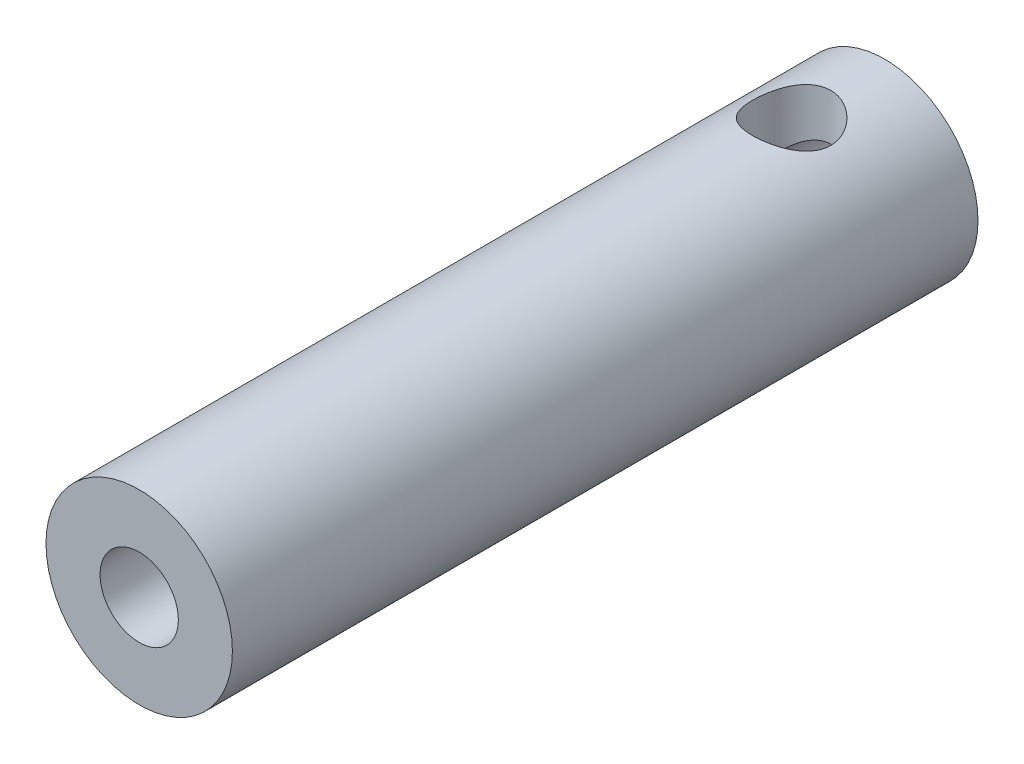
ISO-10303-21;
HEADER;
FILE_DESCRIPTION(('STEP AP214'),'2;1');
FILE_NAME('part.step','',(''),(''),'','','');
FILE_SCHEMA(('AUTOMOTIVE_DESIGN { 1 0 10303 214 1 1 1 1 }'));
ENDSEC;
DATA;
#1=APPLICATION_CONTEXT('core data for automotive mechanical design processes');
#2=APPLICATION_PROTOCOL_DEFINITION('international standard','automotive_design',2000,#1);
#3=PRODUCT_CONTEXT('',#1,'mechanical');
#4=PRODUCT('Part','Part','',(#3));
#5=PRODUCT_RELATED_PRODUCT_CATEGORY('part','',(#4));
#6=PRODUCT_DEFINITION_FORMATION('','',#4);
#7=PRODUCT_DEFINITION_CONTEXT('part definition',#1,'design');
#8=PRODUCT_DEFINITION('design','',#6,#7);
#9=PRODUCT_DEFINITION_SHAPE('','',#8);
#10=(LENGTH_UNIT() NAMED_UNIT(*) SI_UNIT(.MILLI.,.METRE.));
#11=(NAMED_UNIT(*) PLANE_ANGLE_UNIT() SI_UNIT($,.RADIAN.));
#12=(NAMED_UNIT(*) SI_UNIT($,.STERADIAN.) SOLID_ANGLE_UNIT());
#13=UNCERTAINTY_MEASURE_WITH_UNIT(LENGTH_MEASURE(1.E-05),#10,'distance_accuracy_value','');
#14=(GEOMETRIC_REPRESENTATION_CONTEXT(3) GLOBAL_UNCERTAINTY_ASSIGNED_CONTEXT((#13)) GLOBAL_UNIT_ASSIGNED_CONTEXT((#10,
#11,#12)) REPRESENTATION_CONTEXT('',''));
#15=CARTESIAN_POINT('',(0.,0.,0.));
#16=DIRECTION('',(0.,0.,1.));
#17=DIRECTION('',(1.,0.,0.));
#18=AXIS2_PLACEMENT_3D('',#15,#16,#17);
#19=CARTESIAN_POINT('',(0.,0.,40.));
#20=DIRECTION('',(0.,0.,-1.));
#21=DIRECTION('',(-1.,0.,0.));
#22=AXIS2_PLACEMENT_3D('',#19,#20,#21);
#23=CYLINDRICAL_SURFACE('',#22,5.);
#24=CARTESIAN_POINT('',(0.,5.,7.09999999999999));
#25=CARTESIAN_POINT('',(-0.112421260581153,4.99999333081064,7.0999912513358));
#26=CARTESIAN_POINT('',(-0.225000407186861,4.99616592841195,7.0909214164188));
#27=CARTESIAN_POINT('',(-0.446972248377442,4.98123118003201,7.05497450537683));
#28=CARTESIAN_POINT('',(-0.556355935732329,4.97010500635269,7.02805137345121));
#29=CARTESIAN_POINT('',(-0.768350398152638,4.94176430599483,6.95756693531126));
#30=CARTESIAN_POINT('',(-0.870982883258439,4.92457055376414,6.91406236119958));
#31=CARTESIAN_POINT('',(-1.06739278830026,4.8857658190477,6.81188714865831));
#32=CARTESIAN_POINT('',(-1.16117280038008,4.8641561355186,6.75322096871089));
#33=CARTESIAN_POINT('',(-1.34213382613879,4.81744880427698,6.61923837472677));
#34=CARTESIAN_POINT('',(-1.42880573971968,4.79223574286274,6.54327496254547));
#35=CARTESIAN_POINT('',(-1.58861874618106,4.74165902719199,6.37822285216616));
#36=CARTESIAN_POINT('',(-1.66175260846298,4.71629529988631,6.28912718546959));
#37=CARTESIAN_POINT('',(-1.79604183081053,4.66686358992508,6.09492195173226));
#38=CARTESIAN_POINT('',(-1.8564119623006,4.64292449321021,5.98923315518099));
#39=CARTESIAN_POINT('',(-1.9582903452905,4.60088674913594,5.76805063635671));
#40=CARTESIAN_POINT('',(-1.99980846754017,4.58278504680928,5.65256208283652));
#41=CARTESIAN_POINT('',(-2.06069339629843,4.55572282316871,5.42091862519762));
#42=CARTESIAN_POINT('',(-2.08104088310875,4.54635990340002,5.30507032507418));
#43=CARTESIAN_POINT('',(-2.1020655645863,4.53668036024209,5.07125462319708));
#44=CARTESIAN_POINT('',(-2.10275385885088,4.53635863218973,4.95328845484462));
#45=CARTESIAN_POINT('',(-2.08517838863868,4.54445782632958,4.72842726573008));
#46=CARTESIAN_POINT('',(-2.0683911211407,4.55219766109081,4.62138734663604));
#47=CARTESIAN_POINT('',(-2.01882069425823,4.57439532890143,4.41181403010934));
#48=CARTESIAN_POINT('',(-1.98603441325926,4.58885447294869,4.30928151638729));
#49=CARTESIAN_POINT('',(-1.9047552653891,4.62318960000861,4.10902281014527));
#50=CARTESIAN_POINT('',(-1.8559407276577,4.64317507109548,4.01144679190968));
#51=CARTESIAN_POINT('',(-1.74421855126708,4.6862864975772,3.82548751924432));
#52=CARTESIAN_POINT('',(-1.68130530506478,4.70941370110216,3.73710794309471));
#53=CARTESIAN_POINT('',(-1.53682141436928,4.75862189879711,3.56405042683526));
#54=CARTESIAN_POINT('',(-1.4541115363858,4.78478586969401,3.48034449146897));
#55=CARTESIAN_POINT('',(-1.27557303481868,4.83544396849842,3.32766206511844));
#56=CARTESIAN_POINT('',(-1.17974124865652,4.85993769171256,3.25868913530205));
#57=CARTESIAN_POINT('',(-0.974684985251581,4.90522758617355,3.13597384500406));
#58=CARTESIAN_POINT('',(-0.865196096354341,4.92592190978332,3.08263293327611));
#59=CARTESIAN_POINT('',(-0.637707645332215,4.96049707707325,2.99546952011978));
#60=CARTESIAN_POINT('',(-0.519712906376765,4.97438174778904,2.96163605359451));
#61=CARTESIAN_POINT('',(-0.286679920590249,4.99305470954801,2.9164964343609));
#62=CARTESIAN_POINT('',(-0.171936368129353,4.9983686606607,2.90388621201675));
#63=CARTESIAN_POINT('',(0.0581412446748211,5.00098385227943,2.89765565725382));
#64=CARTESIAN_POINT('',(0.173475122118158,4.99828744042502,2.90402976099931));
#65=CARTESIAN_POINT('',(0.395312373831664,4.98552504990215,2.93465874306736));
#66=CARTESIAN_POINT('',(0.501967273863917,4.9758388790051,2.95799252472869));
#67=CARTESIAN_POINT('',(0.709728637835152,4.95047932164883,3.02059068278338));
#68=CARTESIAN_POINT('',(0.810834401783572,4.93480518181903,3.05985706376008));
#69=CARTESIAN_POINT('',(1.00818189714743,4.8983626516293,3.15448695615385));
#70=CARTESIAN_POINT('',(1.10417428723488,4.87745088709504,3.21031345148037));
#71=CARTESIAN_POINT('',(1.2857730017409,4.83275775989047,3.33597087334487));
#72=CARTESIAN_POINT('',(1.37137493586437,4.80897519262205,3.40580768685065));
#73=CARTESIAN_POINT('',(1.53629380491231,4.75896603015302,3.56342906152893));
#74=CARTESIAN_POINT('',(1.61470399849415,4.73268731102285,3.65214822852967));
#75=CARTESIAN_POINT('',(1.75578239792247,4.68218504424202,3.84189457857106));
#76=CARTESIAN_POINT('',(1.81844681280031,4.65796199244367,3.94292471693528));
#77=CARTESIAN_POINT('',(1.92699302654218,4.61412955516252,4.15663233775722));
#78=CARTESIAN_POINT('',(1.97260446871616,4.59459611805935,4.26946387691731));
#79=CARTESIAN_POINT('',(2.04378702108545,4.56338397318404,4.50228555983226));
#80=CARTESIAN_POINT('',(2.06937501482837,4.55169864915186,4.62226958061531));
#81=CARTESIAN_POINT('',(2.09809375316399,4.53852721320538,4.85591227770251));
#82=CARTESIAN_POINT('',(2.10281966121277,4.53631703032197,4.96933490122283));
#83=CARTESIAN_POINT('',(2.09395263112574,4.54041709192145,5.19529294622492));
#84=CARTESIAN_POINT('',(2.08036261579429,4.54672597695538,5.30782850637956));
#85=CARTESIAN_POINT('',(2.03659654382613,4.56648699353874,5.52324018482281));
#86=CARTESIAN_POINT('',(2.00724892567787,4.57958128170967,5.626320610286));
#87=CARTESIAN_POINT('',(1.93361811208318,4.61115138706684,5.82611424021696));
#88=CARTESIAN_POINT('',(1.8893307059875,4.62962872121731,5.92282564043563));
#89=CARTESIAN_POINT('',(1.78398506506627,4.67127236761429,6.11354185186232));
#90=CARTESIAN_POINT('',(1.72207244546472,4.69465512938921,6.2070265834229));
#91=CARTESIAN_POINT('',(1.58442236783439,4.74288120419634,6.38277882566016));
#92=CARTESIAN_POINT('',(1.50867999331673,4.76772503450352,6.46504232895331));
#93=CARTESIAN_POINT('',(1.33881414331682,4.81829681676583,6.62232622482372));
#94=CARTESIAN_POINT('',(1.24374163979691,4.84395273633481,6.69635035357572));
#95=CARTESIAN_POINT('',(1.04160910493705,4.89140406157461,6.82745043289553));
#96=CARTESIAN_POINT('',(0.934543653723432,4.91319771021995,6.88451867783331));
#97=CARTESIAN_POINT('',(0.712909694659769,4.9501639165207,6.97888688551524));
#98=CARTESIAN_POINT('',(0.598488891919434,4.96543696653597,7.01648893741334));
#99=CARTESIAN_POINT('',(0.423046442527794,4.98242021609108,7.0578272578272));
#100=CARTESIAN_POINT('',(0.363983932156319,4.98709206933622,7.06909260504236));
#101=CARTESIAN_POINT('',(0.24499384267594,4.99434801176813,7.08652360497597));
#102=CARTESIAN_POINT('',(0.185066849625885,4.99693345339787,7.09269256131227));
#103=CARTESIAN_POINT('',(0.0833788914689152,4.99947925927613,7.0987597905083));
#104=CARTESIAN_POINT('',(0.0417003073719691,5.00000247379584,7.10000324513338));
#105=CARTESIAN_POINT('',(0.,5.,7.09999999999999));
#106=B_SPLINE_CURVE_WITH_KNOTS('',3,(#24,#25,#26,#27,#28,#29,#30,#31,#32,#33,#34,#35,#36,#37,
#38,#39,#40,#41,#42,#43,#44,#45,#46,#47,#48,#49,#50,#51,#52,#53,#54,#55,#56,#57,#58,#59,#60,#61,
#62,#63,#64,#65,#66,#67,#68,#69,#70,#71,#72,#73,#74,#75,#76,#77,#78,#79,#80,#81,#82,#83,#84,#85,
#86,#87,#88,#89,#90,#91,#92,#93,#94,#95,#96,#97,#98,#99,#100,#101,#102,#103,#104,#105),
.UNSPECIFIED.,.T.,.F.,(4,2,2,2,2,2,2,2,2,2,2,2,2,2,2,2,2,2,2,2,2,2,2,2,2,2,2,2,2,2,2,2,2,2,2,2,
2,2,2,2,4),(0.,0.337117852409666,0.675108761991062,1.01195349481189,1.34869928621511,
1.70109212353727,2.05367263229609,2.42394551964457,2.79402431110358,3.14607251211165,
3.49792194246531,3.82228185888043,4.14670508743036,4.47808378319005,4.80959451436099,
5.16961532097,5.52972305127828,5.8983992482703,6.2668680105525,6.6117364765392,6.9565038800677,
7.28382587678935,7.61118906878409,7.9487414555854,8.28643597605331,8.64863382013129,
9.01091878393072,9.37872565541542,9.74622206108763,10.0850701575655,10.4238641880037,
10.7463772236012,11.0689812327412,11.4111551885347,11.7534510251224,12.1212491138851,
12.4892140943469,12.851283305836,13.0320009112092,13.2126012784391,13.3376480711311),.UNSPECIFIED.);
#107=CARTESIAN_POINT('',(0.,5.,7.09999999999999));
#108=VERTEX_POINT('',#107);
#109=EDGE_CURVE('E72',#108,#108,#106,.T.);
#110=ORIENTED_EDGE('',*,*,#109,.T.);
#111=EDGE_LOOP('',(#110));
#112=FACE_BOUND('',#111,.T.);
#113=CARTESIAN_POINT('',(0.,0.,40.));
#114=DIRECTION('',(0.,0.,1.));
#115=DIRECTION('',(1.,0.,0.));
#116=AXIS2_PLACEMENT_3D('',#113,#114,#115);
#117=CIRCLE('',#116,5.);
#118=CARTESIAN_POINT('',(5.,0.,40.));
#119=VERTEX_POINT('',#118);
#120=EDGE_CURVE('E11',#119,#119,#117,.T.);
#121=ORIENTED_EDGE('',*,*,#120,.F.);
#122=EDGE_LOOP('',(#121));
#123=FACE_BOUND('',#122,.T.);
#124=CARTESIAN_POINT('',(0.,0.,0.));
#125=DIRECTION('',(0.,0.,1.));
#126=DIRECTION('',(1.,0.,0.));
#127=AXIS2_PLACEMENT_3D('',#124,#125,#126);
#128=CIRCLE('',#127,5.);
#129=CARTESIAN_POINT('',(5.,0.,0.));
#130=VERTEX_POINT('',#129);
#131=EDGE_CURVE('E45',#130,#130,#128,.T.);
#132=ORIENTED_EDGE('',*,*,#131,.T.);
#133=EDGE_LOOP('',(#132));
#134=FACE_BOUND('',#133,.T.);
#135=ADVANCED_FACE('F41',(#112,#123,#134),#23,.T.);
#136=CARTESIAN_POINT('',(0.,0.,40.));
#137=DIRECTION('',(0.,0.,1.));
#138=DIRECTION('',(1.,0.,0.));
#139=AXIS2_PLACEMENT_3D('',#136,#137,#138);
#140=PLANE('',#139);
#141=CARTESIAN_POINT('',(0.,0.,40.));
#142=DIRECTION('',(0.,0.,1.));
#143=DIRECTION('',(1.,0.,0.));
#144=AXIS2_PLACEMENT_3D('',#141,#142,#143);
#145=CIRCLE('',#144,2.09999999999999);
#146=CARTESIAN_POINT('',(2.09999999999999,0.,40.));
#147=VERTEX_POINT('',#146);
#148=EDGE_CURVE('E65',#147,#147,#145,.T.);
#149=ORIENTED_EDGE('',*,*,#148,.F.);
#150=EDGE_LOOP('',(#149));
#151=FACE_BOUND('',#150,.T.);
#152=ORIENTED_EDGE('',*,*,#120,.T.);
#153=EDGE_LOOP('',(#152));
#154=FACE_BOUND('',#153,.T.);
#155=ADVANCED_FACE('F86',(#151,#154),#140,.T.);
#156=CARTESIAN_POINT('',(0.,0.,0.));
#157=DIRECTION('',(0.,0.,1.));
#158=DIRECTION('',(1.,0.,0.));
#159=AXIS2_PLACEMENT_3D('',#156,#157,#158);
#160=PLANE('',#159);
#161=CARTESIAN_POINT('',(0.,0.,0.));
#162=DIRECTION('',(0.,0.,-1.));
#163=DIRECTION('',(-1.,0.,0.));
#164=AXIS2_PLACEMENT_3D('',#161,#162,#163);
#165=CIRCLE('',#164,2.5);
#166=CARTESIAN_POINT('',(-2.5,0.,0.));
#167=VERTEX_POINT('',#166);
#168=EDGE_CURVE('E66',#167,#167,#165,.T.);
#169=ORIENTED_EDGE('',*,*,#168,.F.);
#170=EDGE_LOOP('',(#169));
#171=FACE_BOUND('',#170,.T.);
#172=ORIENTED_EDGE('',*,*,#131,.F.);
#173=EDGE_LOOP('',(#172));
#174=FACE_BOUND('',#173,.T.);
#175=ADVANCED_FACE('F83',(#171,#174),#160,.F.);
#176=CARTESIAN_POINT('',(0.,0.,25.));
#177=DIRECTION('',(0.,0.,1.));
#178=DIRECTION('',(1.,0.,0.));
#179=AXIS2_PLACEMENT_3D('',#176,#177,#178);
#180=CONICAL_SURFACE('',#179,2.1,1.02974425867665);
#181=CARTESIAN_POINT('',(0.,0.,23.7381927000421));
#182=VERTEX_POINT('',#181);
#183=VERTEX_LOOP('',#182);
#184=FACE_BOUND('',#183,.T.);
#185=CARTESIAN_POINT('',(0.,0.,25.));
#186=DIRECTION('',(0.,0.,1.));
#187=DIRECTION('',(1.,0.,0.));
#188=AXIS2_PLACEMENT_3D('',#185,#186,#187);
#189=CIRCLE('',#188,2.1);
#190=CARTESIAN_POINT('',(2.1,0.,25.));
#191=VERTEX_POINT('',#190);
#192=EDGE_CURVE('E69',#191,#191,#189,.T.);
#193=ORIENTED_EDGE('',*,*,#192,.T.);
#194=EDGE_LOOP('',(#193));
#195=FACE_BOUND('',#194,.T.);
#196=ADVANCED_FACE('F85',(#184,#195),#180,.F.);
#197=CARTESIAN_POINT('',(0.,0.,40.));
#198=DIRECTION('',(0.,0.,1.));
#199=DIRECTION('',(1.,0.,0.));
#200=AXIS2_PLACEMENT_3D('',#197,#198,#199);
#201=CYLINDRICAL_SURFACE('',#200,2.09999999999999);
#202=ORIENTED_EDGE('',*,*,#192,.F.);
#203=EDGE_LOOP('',(#202));
#204=FACE_BOUND('',#203,.T.);
#205=ORIENTED_EDGE('',*,*,#148,.T.);
#206=EDGE_LOOP('',(#205));
#207=FACE_BOUND('',#206,.T.);
#208=ADVANCED_FACE('F59',(#204,#207),#201,.F.);
#209=CARTESIAN_POINT('',(0.,0.,13.4978484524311));
#210=DIRECTION('',(0.,0.,-1.));
#211=DIRECTION('',(-1.,0.,0.));
#212=AXIS2_PLACEMENT_3D('',#209,#210,#211);
#213=CONICAL_SURFACE('',#212,2.5,1.02974425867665);
#214=CARTESIAN_POINT('',(0.,0.,15.));
#215=VERTEX_POINT('',#214);
#216=VERTEX_LOOP('',#215);
#217=FACE_BOUND('',#216,.T.);
#218=CARTESIAN_POINT('',(0.,0.,13.4978484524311));
#219=DIRECTION('',(0.,0.,-1.));
#220=DIRECTION('',(-1.,0.,0.));
#221=AXIS2_PLACEMENT_3D('',#218,#219,#220);
#222=CIRCLE('',#221,2.5);
#223=CARTESIAN_POINT('',(-2.5,0.,13.4978484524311));
#224=VERTEX_POINT('',#223);
#225=EDGE_CURVE('E63',#224,#224,#222,.T.);
#226=ORIENTED_EDGE('',*,*,#225,.T.);
#227=EDGE_LOOP('',(#226));
#228=FACE_BOUND('',#227,.T.);
#229=ADVANCED_FACE('F55',(#217,#228),#213,.F.);
#230=CARTESIAN_POINT('',(0.,0.,0.));
#231=DIRECTION('',(0.,0.,-1.));
#232=DIRECTION('',(-1.,0.,0.));
#233=AXIS2_PLACEMENT_3D('',#230,#231,#232);
#234=CYLINDRICAL_SURFACE('',#233,2.5);
#235=CARTESIAN_POINT('',(0.,2.5,7.09999999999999));
#236=CARTESIAN_POINT('',(0.0993730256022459,2.49999235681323,7.09999218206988));
#237=CARTESIAN_POINT('',(0.198894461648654,2.49401423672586,7.09288501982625));
#238=CARTESIAN_POINT('',(0.394712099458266,2.47062386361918,7.06495473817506));
#239=CARTESIAN_POINT('',(0.49100041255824,2.45318551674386,7.04410031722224));
#240=CARTESIAN_POINT('',(0.676934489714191,2.40849407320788,6.99024330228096));
#241=CARTESIAN_POINT('',(0.766619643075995,2.38130603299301,6.95732120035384));
#242=CARTESIAN_POINT('',(0.93836403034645,2.31901636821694,6.8810418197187));
#243=CARTESIAN_POINT('',(1.02042318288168,2.28391465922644,6.83768442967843));
#244=CARTESIAN_POINT('',(1.20508095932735,2.19360207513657,6.72437703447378));
#245=CARTESIAN_POINT('',(1.30400396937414,2.13576228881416,6.65052906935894));
#246=CARTESIAN_POINT('',(1.48564887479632,2.0136759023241,6.48919024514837));
#247=CARTESIAN_POINT('',(1.56832369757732,1.94941147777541,6.40166102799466));
#248=CARTESIAN_POINT('',(1.71877589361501,1.81821074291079,6.21271884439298));
#249=CARTESIAN_POINT('',(1.78623999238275,1.75124686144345,6.11107346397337));
#250=CARTESIAN_POINT('',(1.87423794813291,1.65503457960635,5.94919914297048));
#251=CARTESIAN_POINT('',(1.90135639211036,1.62369006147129,5.89371583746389));
#252=CARTESIAN_POINT('',(1.95101171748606,1.56366934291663,5.77938306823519));
#253=CARTESIAN_POINT('',(1.97355246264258,1.53499090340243,5.72053649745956));
#254=CARTESIAN_POINT('',(2.01536124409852,1.47973546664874,5.59422401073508));
#255=CARTESIAN_POINT('',(2.0342028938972,1.4535299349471,5.52644799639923));
#256=CARTESIAN_POINT('',(2.06527249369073,1.40903910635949,5.38695313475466));
#257=CARTESIAN_POINT('',(2.07751605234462,1.39073513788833,5.31524403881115));
#258=CARTESIAN_POINT('',(2.09459755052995,1.36488977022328,5.16794159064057));
#259=CARTESIAN_POINT('',(2.09933757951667,1.35749074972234,5.09230997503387));
#260=CARTESIAN_POINT('',(2.10053165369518,1.3556436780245,4.94083251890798));
#261=CARTESIAN_POINT('',(2.09698775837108,1.36119240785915,4.8649867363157));
#262=CARTESIAN_POINT('',(2.08157225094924,1.38464712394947,4.71114717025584));
#263=CARTESIAN_POINT('',(2.06917552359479,1.4033310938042,4.63333302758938));
#264=CARTESIAN_POINT('',(2.03663853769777,1.45013886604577,4.48219474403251));
#265=CARTESIAN_POINT('',(2.01647195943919,1.47829471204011,4.40888685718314));
#266=CARTESIAN_POINT('',(1.97403882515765,1.53432551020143,4.2811360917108));
#267=CARTESIAN_POINT('',(1.95296589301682,1.56116602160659,4.22581910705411));
#268=CARTESIAN_POINT('',(1.90677427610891,1.61726218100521,4.11815981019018));
#269=CARTESIAN_POINT('',(1.88165311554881,1.64651930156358,4.06581934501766));
#270=CARTESIAN_POINT('',(1.80045722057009,1.73632877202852,3.91293641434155));
#271=CARTESIAN_POINT('',(1.73857376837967,1.79888580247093,3.8166017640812));
#272=CARTESIAN_POINT('',(1.59579178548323,1.92697550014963,3.62956765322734));
#273=CARTESIAN_POINT('',(1.51398796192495,1.99246641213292,3.53953429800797));
#274=CARTESIAN_POINT('',(1.3336214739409,2.11741444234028,3.37321437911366));
#275=CARTESIAN_POINT('',(1.23509319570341,2.17688354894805,3.29690025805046));
#276=CARTESIAN_POINT('',(1.04606866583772,2.27250261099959,3.17646752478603));
#277=CARTESIAN_POINT('',(0.958857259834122,2.31087848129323,3.12897504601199));
#278=CARTESIAN_POINT('',(0.775629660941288,2.37863696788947,3.04590336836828));
#279=CARTESIAN_POINT('',(0.67961847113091,2.40802465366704,3.01031745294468));
#280=CARTESIAN_POINT('',(0.479938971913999,2.45565985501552,2.95292307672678));
#281=CARTESIAN_POINT('',(0.376214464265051,2.47381430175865,2.93122966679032));
#282=CARTESIAN_POINT('',(0.165239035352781,2.49678205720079,2.90381797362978));
#283=CARTESIAN_POINT('',(0.0579910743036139,2.50160628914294,2.8980866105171));
#284=CARTESIAN_POINT('',(-0.141982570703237,2.4977064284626,2.90273147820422));
#285=CARTESIAN_POINT('',(-0.234797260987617,2.490649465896,2.91112558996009));
#286=CARTESIAN_POINT('',(-0.417235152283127,2.46665360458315,2.93979574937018));
#287=CARTESIAN_POINT('',(-0.506858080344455,2.4497138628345,2.96007281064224));
#288=CARTESIAN_POINT('',(-0.680859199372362,2.40717070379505,3.01136321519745));
#289=CARTESIAN_POINT('',(-0.765231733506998,2.3815581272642,3.0423879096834));
#290=CARTESIAN_POINT('',(-0.927287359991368,2.32326696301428,3.1137365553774));
#291=CARTESIAN_POINT('',(-1.00496777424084,2.29058556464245,3.15406420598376));
#292=CARTESIAN_POINT('',(-1.18582278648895,2.20405034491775,3.2623755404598));
#293=CARTESIAN_POINT('',(-1.28500120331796,2.14723900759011,3.3346880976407));
#294=CARTESIAN_POINT('',(-1.46741117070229,2.02699462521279,3.49289539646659));
#295=CARTESIAN_POINT('',(-1.5505969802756,1.96354336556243,3.57882785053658));
#296=CARTESIAN_POINT('',(-1.70228679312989,1.83365930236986,3.76434086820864));
#297=CARTESIAN_POINT('',(-1.77049341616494,1.7671931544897,3.8641429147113));
#298=CARTESIAN_POINT('',(-1.85989841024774,1.6711398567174,4.02304074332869));
#299=CARTESIAN_POINT('',(-1.88753704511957,1.63974677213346,4.07750514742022));
#300=CARTESIAN_POINT('',(-1.93835723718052,1.57934206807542,4.1897130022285));
#301=CARTESIAN_POINT('',(-1.96154209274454,1.55032869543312,4.24745398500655));
#302=CARTESIAN_POINT('',(-2.00546732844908,1.49316445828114,4.3730947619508));
#303=CARTESIAN_POINT('',(-2.02564470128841,1.46547259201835,4.44140862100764));
#304=CARTESIAN_POINT('',(-2.05928882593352,1.41780992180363,4.58221125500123));
#305=CARTESIAN_POINT('',(-2.07277001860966,1.39782252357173,4.65469066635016));
#306=CARTESIAN_POINT('',(-2.09220045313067,1.36858699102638,4.80399486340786));
#307=CARTESIAN_POINT('',(-2.09804139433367,1.35949342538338,4.88086634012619));
#308=CARTESIAN_POINT('',(-2.10111949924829,1.35473717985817,5.03518243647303));
#309=CARTESIAN_POINT('',(-2.09836281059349,1.35906490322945,5.11262660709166));
#310=CARTESIAN_POINT('',(-2.08565152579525,1.37845870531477,5.25362800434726));
#311=CARTESIAN_POINT('',(-2.07682414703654,1.39183839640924,5.31754241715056));
#312=CARTESIAN_POINT('',(-2.05382763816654,1.42555682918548,5.44253378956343));
#313=CARTESIAN_POINT('',(-2.03965016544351,1.44590643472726,5.503606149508));
#314=CARTESIAN_POINT('',(-1.99332588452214,1.50969345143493,5.67009294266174));
#315=CARTESIAN_POINT('',(-1.95587568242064,1.55858039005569,5.77191180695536));
#316=CARTESIAN_POINT('',(-1.86775331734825,1.66319886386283,5.96586305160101));
#317=CARTESIAN_POINT('',(-1.81704180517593,1.71895050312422,6.05796543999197));
#318=CARTESIAN_POINT('',(-1.69917403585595,1.83580085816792,6.23904881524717));
#319=CARTESIAN_POINT('',(-1.63113117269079,1.89700470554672,6.32738697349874));
#320=CARTESIAN_POINT('',(-1.48087039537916,2.01649069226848,6.49315309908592));
#321=CARTESIAN_POINT('',(-1.39867179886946,2.07477667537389,6.57059567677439));
#322=CARTESIAN_POINT('',(-1.22871778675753,2.17927144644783,6.70613252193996));
#323=CARTESIAN_POINT('',(-1.14226966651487,2.22610312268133,6.76537388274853));
#324=CARTESIAN_POINT('',(-0.958257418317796,2.31127343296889,6.87162845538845));
#325=CARTESIAN_POINT('',(-0.860700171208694,2.3496172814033,6.9186491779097));
#326=CARTESIAN_POINT('',(-0.672523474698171,2.40953347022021,6.99153373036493));
#327=CARTESIAN_POINT('',(-0.583294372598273,2.43280819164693,7.01957966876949));
#328=CARTESIAN_POINT('',(-0.400084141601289,2.46953481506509,7.0636747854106));
#329=CARTESIAN_POINT('',(-0.306115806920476,2.48301179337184,7.07975459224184));
#330=CARTESIAN_POINT('',(-0.176152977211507,2.49403576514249,7.09289668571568));
#331=CARTESIAN_POINT('',(-0.141020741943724,2.49626804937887,7.09555605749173));
#332=CARTESIAN_POINT('',(-0.0705986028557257,2.49925166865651,7.09910927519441));
#333=CARTESIAN_POINT('',(-0.0353086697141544,2.50000271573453,7.10000277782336));
#334=CARTESIAN_POINT('',(0.,2.5,7.09999999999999));
#335=B_SPLINE_CURVE_WITH_KNOTS('',3,(#235,#236,#237,#238,#239,#240,#241,#242,#243,#244,#245,
#246,#247,#248,#249,#250,#251,#252,#253,#254,#255,#256,#257,#258,#259,#260,#261,#262,#263,#264,
#265,#266,#267,#268,#269,#270,#271,#272,#273,#274,#275,#276,#277,#278,#279,#280,#281,#282,#283,
#284,#285,#286,#287,#288,#289,#290,#291,#292,#293,#294,#295,#296,#297,#298,#299,#300,#301,#302,
#303,#304,#305,#306,#307,#308,#309,#310,#311,#312,#313,#314,#315,#316,#317,#318,#319,#320,#321,
#322,#323,#324,#325,#326,#327,#328,#329,#330,#331,#332,#333,#334),.UNSPECIFIED.,.T.,.F.,(4,2,2,
2,2,2,2,2,2,2,2,2,2,2,2,2,2,2,2,2,2,2,2,2,2,2,2,2,2,2,2,2,2,2,2,2,2,2,2,2,2,2,2,2,2,2,2,2,2,4),
(0.,0.297962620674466,0.596606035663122,0.893292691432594,1.18998251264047,1.59675200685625,
2.00468312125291,2.42037345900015,2.62792558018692,2.83530178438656,3.05987449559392,
3.28391359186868,3.51085267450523,3.73773534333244,3.97933039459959,4.22175112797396,
4.41648056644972,4.61132955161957,5.00126650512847,5.41417045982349,5.82623552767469,
6.14441396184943,6.46241260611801,6.78301181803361,7.10334824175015,7.38236969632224,
7.6614149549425,7.94075583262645,8.22020798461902,8.62374969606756,9.02842895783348,
9.44053313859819,9.64634836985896,9.85201058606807,10.0806637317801,10.3088216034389,
10.5401797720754,10.771372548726,10.9683042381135,11.1655442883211,11.5205132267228,
11.8765476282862,12.2568989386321,12.6367352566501,12.9798180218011,13.3226894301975,
13.610660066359,13.8978910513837,14.0037408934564,14.1096113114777),.UNSPECIFIED.);
#336=CARTESIAN_POINT('',(0.,2.5,7.09999999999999));
#337=VERTEX_POINT('',#336);
#338=EDGE_CURVE('E106',#337,#337,#335,.T.);
#339=ORIENTED_EDGE('',*,*,#338,.T.);
#340=EDGE_LOOP('',(#339));
#341=FACE_BOUND('',#340,.T.);
#342=ORIENTED_EDGE('',*,*,#225,.F.);
#343=EDGE_LOOP('',(#342));
#344=FACE_BOUND('',#343,.T.);
#345=ORIENTED_EDGE('',*,*,#168,.T.);
#346=EDGE_LOOP('',(#345));
#347=FACE_BOUND('',#346,.T.);
#348=ADVANCED_FACE('F58',(#341,#344,#347),#234,.F.);
#349=CARTESIAN_POINT('',(0.,5.,5.));
#350=DIRECTION('',(0.,1.,0.));
#351=DIRECTION('',(0.,0.,1.));
#352=AXIS2_PLACEMENT_3D('',#349,#350,#351);
#353=CYLINDRICAL_SURFACE('',#352,2.09999999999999);
#354=ORIENTED_EDGE('',*,*,#338,.F.);
#355=EDGE_LOOP('',(#354));
#356=FACE_BOUND('',#355,.T.);
#357=ORIENTED_EDGE('',*,*,#109,.F.);
#358=EDGE_LOOP('',(#357));
#359=FACE_BOUND('',#358,.T.);
#360=ADVANCED_FACE('F117',(#356,#359),#353,.F.);
#361=CLOSED_SHELL('',(#135,#155,#175,#196,#208,#229,#348,#360));
#362=MANIFOLD_SOLID_BREP('B2',#361);
#363=ADVANCED_BREP_SHAPE_REPRESENTATION('',(#18,#362),#14);
#364=SHAPE_DEFINITION_REPRESENTATION(#9,#363);
ENDSEC;
END-ISO-10303-21;
